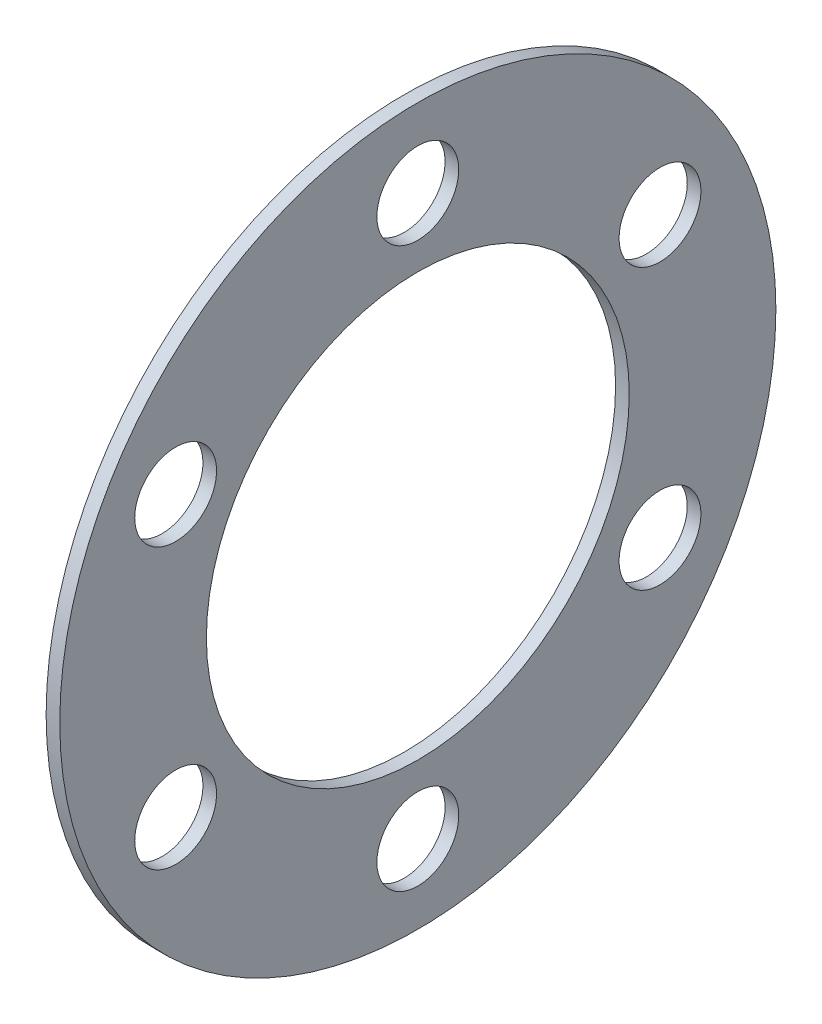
ISO-10303-21;
HEADER;
FILE_DESCRIPTION(('STEP AP214'),'2;1');
FILE_NAME('part.step','',(''),(''),'','','');
FILE_SCHEMA(('AUTOMOTIVE_DESIGN { 1 0 10303 214 1 1 1 1 }'));
ENDSEC;
DATA;
#1=APPLICATION_CONTEXT('core data for automotive mechanical design processes');
#2=APPLICATION_PROTOCOL_DEFINITION('international standard','automotive_design',2000,#1);
#3=PRODUCT_CONTEXT('',#1,'mechanical');
#4=PRODUCT('Part','Part','',(#3));
#5=PRODUCT_RELATED_PRODUCT_CATEGORY('part','',(#4));
#6=PRODUCT_DEFINITION_FORMATION('','',#4);
#7=PRODUCT_DEFINITION_CONTEXT('part definition',#1,'design');
#8=PRODUCT_DEFINITION('design','',#6,#7);
#9=PRODUCT_DEFINITION_SHAPE('','',#8);
#10=(LENGTH_UNIT() NAMED_UNIT(*) SI_UNIT(.MILLI.,.METRE.));
#11=(NAMED_UNIT(*) PLANE_ANGLE_UNIT() SI_UNIT($,.RADIAN.));
#12=(NAMED_UNIT(*) SI_UNIT($,.STERADIAN.) SOLID_ANGLE_UNIT());
#13=UNCERTAINTY_MEASURE_WITH_UNIT(LENGTH_MEASURE(1.E-05),#10,'distance_accuracy_value','');
#14=(GEOMETRIC_REPRESENTATION_CONTEXT(3) GLOBAL_UNCERTAINTY_ASSIGNED_CONTEXT((#13)) GLOBAL_UNIT_ASSIGNED_CONTEXT((#10,
#11,#12)) REPRESENTATION_CONTEXT('',''));
#15=CARTESIAN_POINT('',(0.,0.,0.));
#16=DIRECTION('',(0.,0.,1.));
#17=DIRECTION('',(1.,0.,0.));
#18=AXIS2_PLACEMENT_3D('',#15,#16,#17);
#19=CARTESIAN_POINT('',(2.,-14.7564583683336,0.));
#20=DIRECTION('',(-1.,0.,0.));
#21=DIRECTION('',(0.,0.,1.));
#22=AXIS2_PLACEMENT_3D('',#19,#20,#21);
#23=PLANE('',#22);
#24=CARTESIAN_POINT('',(2.,20.5000000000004,35.5070415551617));
#25=DIRECTION('',(-1.,0.,0.));
#26=DIRECTION('',(0.,0.,1.));
#27=AXIS2_PLACEMENT_3D('',#24,#25,#26);
#28=CIRCLE('',#27,6.);
#29=CARTESIAN_POINT('',(2.,20.5000000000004,41.5070415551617));
#30=VERTEX_POINT('',#29);
#31=EDGE_CURVE('E79',#30,#30,#28,.F.);
#32=ORIENTED_EDGE('',*,*,#31,.F.);
#33=EDGE_LOOP('',(#32));
#34=FACE_BOUND('',#33,.T.);
#35=CARTESIAN_POINT('',(2.,-20.4999999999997,35.5070415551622));
#36=DIRECTION('',(-1.,0.,0.));
#37=DIRECTION('',(0.,0.,1.));
#38=AXIS2_PLACEMENT_3D('',#35,#36,#37);
#39=CIRCLE('',#38,6.);
#40=CARTESIAN_POINT('',(2.,-20.4999999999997,41.5070415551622));
#41=VERTEX_POINT('',#40);
#42=EDGE_CURVE('E73',#41,#41,#39,.F.);
#43=ORIENTED_EDGE('',*,*,#42,.F.);
#44=EDGE_LOOP('',(#43));
#45=FACE_BOUND('',#44,.T.);
#46=CARTESIAN_POINT('',(2.,-41.,2.86301635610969E-13));
#47=DIRECTION('',(-1.,0.,0.));
#48=DIRECTION('',(0.,0.,1.));
#49=AXIS2_PLACEMENT_3D('',#46,#47,#48);
#50=CIRCLE('',#49,6.);
#51=CARTESIAN_POINT('',(2.,-41.,6.00000000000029));
#52=VERTEX_POINT('',#51);
#53=EDGE_CURVE('E67',#52,#52,#50,.F.);
#54=ORIENTED_EDGE('',*,*,#53,.F.);
#55=EDGE_LOOP('',(#54));
#56=FACE_BOUND('',#55,.T.);
#57=CARTESIAN_POINT('',(2.,-20.5000000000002,-35.5070415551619));
#58=DIRECTION('',(-1.,0.,0.));
#59=DIRECTION('',(0.,0.,1.));
#60=AXIS2_PLACEMENT_3D('',#57,#58,#59);
#61=CIRCLE('',#60,6.);
#62=CARTESIAN_POINT('',(2.,-20.5000000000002,-29.5070415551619));
#63=VERTEX_POINT('',#62);
#64=EDGE_CURVE('E61',#63,#63,#61,.F.);
#65=ORIENTED_EDGE('',*,*,#64,.F.);
#66=EDGE_LOOP('',(#65));
#67=FACE_BOUND('',#66,.T.);
#68=CARTESIAN_POINT('',(2.,20.4999999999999,-35.507041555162));
#69=DIRECTION('',(-1.,0.,0.));
#70=DIRECTION('',(0.,0.,1.));
#71=AXIS2_PLACEMENT_3D('',#68,#69,#70);
#72=CIRCLE('',#71,6.);
#73=CARTESIAN_POINT('',(2.,20.4999999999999,-29.507041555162));
#74=VERTEX_POINT('',#73);
#75=EDGE_CURVE('E55',#74,#74,#72,.F.);
#76=ORIENTED_EDGE('',*,*,#75,.F.);
#77=EDGE_LOOP('',(#76));
#78=FACE_BOUND('',#77,.T.);
#79=CARTESIAN_POINT('',(2.,0.,0.));
#80=DIRECTION('',(-1.,0.,0.));
#81=DIRECTION('',(0.,0.,1.));
#82=AXIS2_PLACEMENT_3D('',#79,#80,#81);
#83=CIRCLE('',#82,31.);
#84=CARTESIAN_POINT('',(2.,0.,31.));
#85=VERTEX_POINT('',#84);
#86=EDGE_CURVE('E49',#85,#85,#83,.F.);
#87=ORIENTED_EDGE('',*,*,#86,.F.);
#88=EDGE_LOOP('',(#87));
#89=FACE_BOUND('',#88,.T.);
#90=CARTESIAN_POINT('',(2.,41.,0.));
#91=DIRECTION('',(-1.,0.,0.));
#92=DIRECTION('',(0.,0.,1.));
#93=AXIS2_PLACEMENT_3D('',#90,#91,#92);
#94=CIRCLE('',#93,6.);
#95=CARTESIAN_POINT('',(2.,41.,6.));
#96=VERTEX_POINT('',#95);
#97=EDGE_CURVE('E40',#96,#96,#94,.F.);
#98=ORIENTED_EDGE('',*,*,#97,.F.);
#99=EDGE_LOOP('',(#98));
#100=FACE_BOUND('',#99,.T.);
#101=CARTESIAN_POINT('',(2.,0.,0.));
#102=DIRECTION('',(1.,0.,0.));
#103=DIRECTION('',(0.,0.,-1.));
#104=AXIS2_PLACEMENT_3D('',#101,#102,#103);
#105=CIRCLE('',#104,52.5);
#106=CARTESIAN_POINT('',(2.,0.,-52.5));
#107=VERTEX_POINT('',#106);
#108=EDGE_CURVE('E10',#107,#107,#105,.T.);
#109=ORIENTED_EDGE('',*,*,#108,.T.);
#110=EDGE_LOOP('',(#109));
#111=FACE_BOUND('',#110,.T.);
#112=ADVANCED_FACE('F30',(#34,#45,#56,#67,#78,#89,#100,#111),#23,.F.);
#113=CARTESIAN_POINT('',(29.9069920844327,0.,0.));
#114=DIRECTION('',(1.,0.,0.));
#115=DIRECTION('',(0.,0.,-1.));
#116=AXIS2_PLACEMENT_3D('',#113,#114,#115);
#117=CYLINDRICAL_SURFACE('',#116,52.5);
#118=ORIENTED_EDGE('',*,*,#108,.F.);
#119=EDGE_LOOP('',(#118));
#120=FACE_BOUND('',#119,.T.);
#121=CARTESIAN_POINT('',(0.,0.,0.));
#122=DIRECTION('',(1.,0.,0.));
#123=DIRECTION('',(0.,0.,-1.));
#124=AXIS2_PLACEMENT_3D('',#121,#122,#123);
#125=CIRCLE('',#124,52.5);
#126=CARTESIAN_POINT('',(0.,0.,-52.5));
#127=VERTEX_POINT('',#126);
#128=EDGE_CURVE('E36',#127,#127,#125,.T.);
#129=ORIENTED_EDGE('',*,*,#128,.T.);
#130=EDGE_LOOP('',(#129));
#131=FACE_BOUND('',#130,.T.);
#132=ADVANCED_FACE('F93',(#120,#131),#117,.T.);
#133=CARTESIAN_POINT('',(0.,-14.7564583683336,0.));
#134=DIRECTION('',(1.,0.,0.));
#135=DIRECTION('',(0.,0.,-1.));
#136=AXIS2_PLACEMENT_3D('',#133,#134,#135);
#137=PLANE('',#136);
#138=CARTESIAN_POINT('',(0.,20.5000000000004,35.5070415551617));
#139=DIRECTION('',(-1.,0.,0.));
#140=DIRECTION('',(0.,-0.866025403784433,0.50000000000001));
#141=AXIS2_PLACEMENT_3D('',#138,#139,#140);
#142=CIRCLE('',#141,6.);
#143=CARTESIAN_POINT('',(0.,15.3038475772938,38.5070415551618));
#144=VERTEX_POINT('',#143);
#145=EDGE_CURVE('E82',#144,#144,#142,.T.);
#146=ORIENTED_EDGE('',*,*,#145,.F.);
#147=EDGE_LOOP('',(#146));
#148=FACE_BOUND('',#147,.T.);
#149=CARTESIAN_POINT('',(0.,-20.4999999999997,35.5070415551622));
#150=DIRECTION('',(-1.,0.,0.));
#151=DIRECTION('',(0.,-0.866025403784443,-0.499999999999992));
#152=AXIS2_PLACEMENT_3D('',#149,#150,#151);
#153=CIRCLE('',#152,6.);
#154=CARTESIAN_POINT('',(0.,-25.6961524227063,32.5070415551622));
#155=VERTEX_POINT('',#154);
#156=EDGE_CURVE('E76',#155,#155,#153,.T.);
#157=ORIENTED_EDGE('',*,*,#156,.F.);
#158=EDGE_LOOP('',(#157));
#159=FACE_BOUND('',#158,.T.);
#160=CARTESIAN_POINT('',(0.,-41.,2.86301635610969E-13));
#161=DIRECTION('',(-1.,0.,0.));
#162=DIRECTION('',(0.,0.,-1.));
#163=AXIS2_PLACEMENT_3D('',#160,#161,#162);
#164=CIRCLE('',#163,6.);
#165=CARTESIAN_POINT('',(0.,-41.,-5.99999999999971));
#166=VERTEX_POINT('',#165);
#167=EDGE_CURVE('E70',#166,#166,#164,.T.);
#168=ORIENTED_EDGE('',*,*,#167,.F.);
#169=EDGE_LOOP('',(#168));
#170=FACE_BOUND('',#169,.T.);
#171=CARTESIAN_POINT('',(0.,-20.5000000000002,-35.5070415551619));
#172=DIRECTION('',(-1.,0.,0.));
#173=DIRECTION('',(0.,0.866025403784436,-0.500000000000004));
#174=AXIS2_PLACEMENT_3D('',#171,#172,#173);
#175=CIRCLE('',#174,6.);
#176=CARTESIAN_POINT('',(0.,-15.3038475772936,-38.5070415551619));
#177=VERTEX_POINT('',#176);
#178=EDGE_CURVE('E64',#177,#177,#175,.T.);
#179=ORIENTED_EDGE('',*,*,#178,.F.);
#180=EDGE_LOOP('',(#179));
#181=FACE_BOUND('',#180,.T.);
#182=CARTESIAN_POINT('',(0.,20.4999999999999,-35.507041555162));
#183=DIRECTION('',(-1.,0.,0.));
#184=DIRECTION('',(0.,0.86602540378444,0.499999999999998));
#185=AXIS2_PLACEMENT_3D('',#182,#183,#184);
#186=CIRCLE('',#185,6.);
#187=CARTESIAN_POINT('',(0.,25.6961524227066,-32.507041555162));
#188=VERTEX_POINT('',#187);
#189=EDGE_CURVE('E58',#188,#188,#186,.T.);
#190=ORIENTED_EDGE('',*,*,#189,.F.);
#191=EDGE_LOOP('',(#190));
#192=FACE_BOUND('',#191,.T.);
#193=CARTESIAN_POINT('',(0.,0.,0.));
#194=DIRECTION('',(-1.,0.,0.));
#195=DIRECTION('',(0.,0.,1.));
#196=AXIS2_PLACEMENT_3D('',#193,#194,#195);
#197=CIRCLE('',#196,31.);
#198=CARTESIAN_POINT('',(0.,0.,31.));
#199=VERTEX_POINT('',#198);
#200=EDGE_CURVE('E52',#199,#199,#197,.T.);
#201=ORIENTED_EDGE('',*,*,#200,.F.);
#202=EDGE_LOOP('',(#201));
#203=FACE_BOUND('',#202,.T.);
#204=CARTESIAN_POINT('',(0.,41.,0.));
#205=DIRECTION('',(-1.,0.,0.));
#206=DIRECTION('',(0.,0.,1.));
#207=AXIS2_PLACEMENT_3D('',#204,#205,#206);
#208=CIRCLE('',#207,6.);
#209=CARTESIAN_POINT('',(0.,41.,6.));
#210=VERTEX_POINT('',#209);
#211=EDGE_CURVE('E44',#210,#210,#208,.T.);
#212=ORIENTED_EDGE('',*,*,#211,.F.);
#213=EDGE_LOOP('',(#212));
#214=FACE_BOUND('',#213,.T.);
#215=ORIENTED_EDGE('',*,*,#128,.F.);
#216=EDGE_LOOP('',(#215));
#217=FACE_BOUND('',#216,.T.);
#218=ADVANCED_FACE('F89',(#148,#159,#170,#181,#192,#203,#214,#217),#137,.F.);
#219=CARTESIAN_POINT('',(2.001,41.,0.));
#220=DIRECTION('',(-1.,0.,0.));
#221=DIRECTION('',(0.,0.,1.));
#222=AXIS2_PLACEMENT_3D('',#219,#220,#221);
#223=CYLINDRICAL_SURFACE('',#222,6.);
#224=ORIENTED_EDGE('',*,*,#211,.T.);
#225=EDGE_LOOP('',(#224));
#226=FACE_BOUND('',#225,.T.);
#227=ORIENTED_EDGE('',*,*,#97,.T.);
#228=EDGE_LOOP('',(#227));
#229=FACE_BOUND('',#228,.T.);
#230=ADVANCED_FACE('F92',(#226,#229),#223,.F.);
#231=CARTESIAN_POINT('',(2.001,0.,0.));
#232=DIRECTION('',(-1.,0.,0.));
#233=DIRECTION('',(0.,0.,1.));
#234=AXIS2_PLACEMENT_3D('',#231,#232,#233);
#235=CYLINDRICAL_SURFACE('',#234,31.);
#236=ORIENTED_EDGE('',*,*,#200,.T.);
#237=EDGE_LOOP('',(#236));
#238=FACE_BOUND('',#237,.T.);
#239=ORIENTED_EDGE('',*,*,#86,.T.);
#240=EDGE_LOOP('',(#239));
#241=FACE_BOUND('',#240,.T.);
#242=ADVANCED_FACE('F110',(#238,#241),#235,.F.);
#243=CARTESIAN_POINT('',(2.001,20.4999999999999,-35.507041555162));
#244=DIRECTION('',(-1.,0.,0.));
#245=DIRECTION('',(0.,0.,1.));
#246=AXIS2_PLACEMENT_3D('',#243,#244,#245);
#247=CYLINDRICAL_SURFACE('',#246,6.);
#248=ORIENTED_EDGE('',*,*,#189,.T.);
#249=EDGE_LOOP('',(#248));
#250=FACE_BOUND('',#249,.T.);
#251=ORIENTED_EDGE('',*,*,#75,.T.);
#252=EDGE_LOOP('',(#251));
#253=FACE_BOUND('',#252,.T.);
#254=ADVANCED_FACE('F133',(#250,#253),#247,.F.);
#255=CARTESIAN_POINT('',(2.001,-20.5000000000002,-35.5070415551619));
#256=DIRECTION('',(-1.,0.,0.));
#257=DIRECTION('',(0.,0.,1.));
#258=AXIS2_PLACEMENT_3D('',#255,#256,#257);
#259=CYLINDRICAL_SURFACE('',#258,6.);
#260=ORIENTED_EDGE('',*,*,#178,.T.);
#261=EDGE_LOOP('',(#260));
#262=FACE_BOUND('',#261,.T.);
#263=ORIENTED_EDGE('',*,*,#64,.T.);
#264=EDGE_LOOP('',(#263));
#265=FACE_BOUND('',#264,.T.);
#266=ADVANCED_FACE('F139',(#262,#265),#259,.F.);
#267=CARTESIAN_POINT('',(2.001,-41.,2.86301635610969E-13));
#268=DIRECTION('',(-1.,0.,0.));
#269=DIRECTION('',(0.,0.,1.));
#270=AXIS2_PLACEMENT_3D('',#267,#268,#269);
#271=CYLINDRICAL_SURFACE('',#270,6.);
#272=ORIENTED_EDGE('',*,*,#167,.T.);
#273=EDGE_LOOP('',(#272));
#274=FACE_BOUND('',#273,.T.);
#275=ORIENTED_EDGE('',*,*,#53,.T.);
#276=EDGE_LOOP('',(#275));
#277=FACE_BOUND('',#276,.T.);
#278=ADVANCED_FACE('F145',(#274,#277),#271,.F.);
#279=CARTESIAN_POINT('',(2.001,-20.4999999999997,35.5070415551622));
#280=DIRECTION('',(-1.,0.,0.));
#281=DIRECTION('',(0.,0.,1.));
#282=AXIS2_PLACEMENT_3D('',#279,#280,#281);
#283=CYLINDRICAL_SURFACE('',#282,6.);
#284=ORIENTED_EDGE('',*,*,#156,.T.);
#285=EDGE_LOOP('',(#284));
#286=FACE_BOUND('',#285,.T.);
#287=ORIENTED_EDGE('',*,*,#42,.T.);
#288=EDGE_LOOP('',(#287));
#289=FACE_BOUND('',#288,.T.);
#290=ADVANCED_FACE('F149',(#286,#289),#283,.F.);
#291=CARTESIAN_POINT('',(2.001,20.5000000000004,35.5070415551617));
#292=DIRECTION('',(-1.,0.,0.));
#293=DIRECTION('',(0.,0.,1.));
#294=AXIS2_PLACEMENT_3D('',#291,#292,#293);
#295=CYLINDRICAL_SURFACE('',#294,6.);
#296=ORIENTED_EDGE('',*,*,#145,.T.);
#297=EDGE_LOOP('',(#296));
#298=FACE_BOUND('',#297,.T.);
#299=ORIENTED_EDGE('',*,*,#31,.T.);
#300=EDGE_LOOP('',(#299));
#301=FACE_BOUND('',#300,.T.);
#302=ADVANCED_FACE('F86',(#298,#301),#295,.F.);
#303=CLOSED_SHELL('',(#112,#132,#218,#230,#242,#254,#266,#278,#290,#302));
#304=MANIFOLD_SOLID_BREP('B2',#303);
#305=ADVANCED_BREP_SHAPE_REPRESENTATION('',(#18,#304),#14);
#306=SHAPE_DEFINITION_REPRESENTATION(#9,#305);
ENDSEC;
END-ISO-10303-21;
